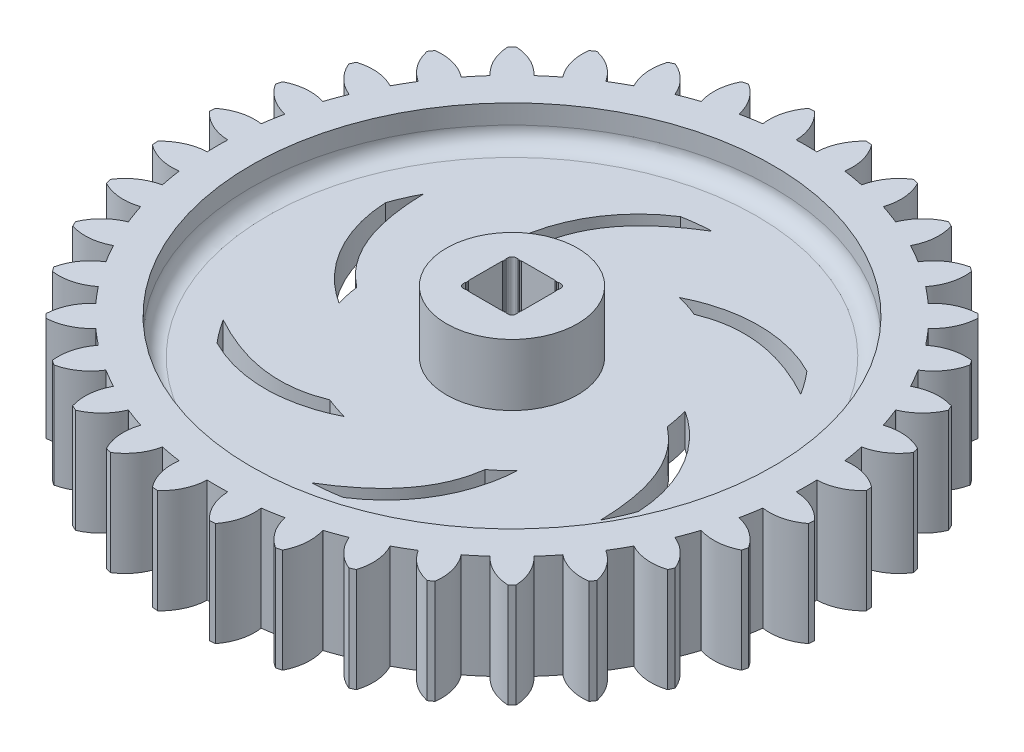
from build123d import *

# Parameters (mm, degrees)
EXTRUDE3_DEPTH     = 3.175
CIRPATTERN1_COUNT  = 36
CUT_EXTRUDE1_DEPTH = 2
CIRPATTERN2_COUNT  = 6
CUT_EXTRUDE2_DEPTH = 9.52
FILLET1_R          = 0.25
FILLET2_R          = 1


with BuildPart() as part:
    # Sketch3 → Revolve1 (revolve)
    with BuildSketch(Plane.XY, mode=Mode.PRIVATE) as revolve1_sk:
        Polygon((0, 4.76), (4, 4.76), (4, 1), (15.92, 1), (15.92, 3.175), (17.98, 3.175), (17.98, -3.175), (15.92, -3.175), (15.92, -1), (4, -1), (4, -4.76), (0, -4.76), align=None)
    revolve(revolve1_sk.sketch.rotate(Axis((0, 37.828653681, 0), (0, -1, 0)), 90), axis=Axis((0, 37.828653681, 0), (0, -1, 0)))

    # Sketch4 → Extrude3 (add, symmetric)
    with BuildSketch(Plane(origin=(0, 0, 0), x_dir=(1, 0, 0), z_dir=(0, 1, 0))):
        with BuildLine():
            Line((-2.503167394, 17.810961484), (-2.460580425, 17.507939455))
            ThreePointArc((-2.460580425, 17.507939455), (-1.540913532, 17.612722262), (-0.617023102, 17.669229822))
            Line((-0.617023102, 17.669229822), (-0.627702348, 17.975043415))
            ThreePointArc((-0.627702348, 17.975043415), (-0.89530304, 19.103785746), (-1.577349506, 20.042125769))
            ThreePointArc((-1.577349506, 20.042125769), (-1.752187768, 20.02759783), (-1.926892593, 20.011544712))
            ThreePointArc((-1.926892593, 20.011544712), (-2.435636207, 18.969024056), (-2.503167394, 17.810961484))
        make_face()
    extrude3 = extrude(amount=EXTRUDE3_DEPTH, both=True)

    # CirPattern1: Extrude3 ×36 about axis
    cirpattern1_axis = Axis((0, 0, 0), (0, 1, 0))
    for i in range(1, CIRPATTERN1_COUNT):
        add(extrude3.rotate(cirpattern1_axis, i * 360 / CIRPATTERN1_COUNT))

    # Sketch5 → Cut-Extrude1 (cut)
    with BuildSketch(Plane(origin=(0, 1, 0), x_dir=(1, 0, 0), z_dir=(0, 1, 0))):
        with BuildLine():
            ThreePointArc((-0.538693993, 12.756085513), (-1.411595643, 12.68918069), (-2.277860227, 12.562613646))
            add(Edge.make_bspline(
                [(-2.277860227, 12.562613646), (-2.278837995, 12.561982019), (-2.285488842, 12.557683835), (-2.757067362, 12.252046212), (-3.594776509, 11.586164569), (-4.59578084, 10.443819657), (-5.365528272, 9.162147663), (-5.903631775, 7.741793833), (-6.112446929, 6.610395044), (-6.160400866, 5.947536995), (-6.166292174, 5.839940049), (-6.167118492, 5.824106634)],
                knots=[-0.00040565, -0.00040565, -0.00040565, -0.00040565, 0, 0.002354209, 0.195571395, 0.388788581, 0.582005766, 0.775222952, 0.968440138, 1, 1.005436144, 1.005436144, 1.005436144, 1.005436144], degree=3))
            ThreePointArc((-6.167118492, 5.824106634), (-5.665044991, 6.313543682), (-5.124264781, 6.759843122))
            add(Edge.make_bspline(
                [(-5.124264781, 6.759843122), (-5.123935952, 6.76222343), (-5.121744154, 6.778032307), (-5.046830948, 7.305745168), (-4.795016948, 8.273957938), (-4.152616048, 9.533891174), (-3.275144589, 10.647388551), (-2.197258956, 11.63810404), (-1.263490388, 12.304176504), (-0.689777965, 12.664029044), (-0.558075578, 12.744318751), (-0.538693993, 12.756085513)],
                knots=[-0.000879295, -0.000879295, -0.000879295, -0.000879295, 0, 0.004962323, 0.194509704, 0.384057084, 0.573604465, 0.763151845, 0.952699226, 1, 1.008142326, 1.008142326, 1.008142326, 1.008142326], degree=3))
        make_face()
    cut_extrude1 = extrude(amount=-CUT_EXTRUDE1_DEPTH, mode=Mode.SUBTRACT)

    # CirPattern2: Cut-Extrude1 ×6 about axis
    cirpattern2_axis = Axis((0, 37.828653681, 0), (0, -1, 0))
    for i in range(1, CIRPATTERN2_COUNT):
        add(cut_extrude1.rotate(cirpattern2_axis, i * 360 / CIRPATTERN2_COUNT), mode=Mode.SUBTRACT)

    # Sketch6 → Cut-Extrude2 (cut)
    with BuildSketch(Plane(origin=(0, 4.76, 0), x_dir=(1, 0, 0), z_dir=(0, 1, 0))):
        Polygon((-1.2325, 1.6125), (-1.6125, 1.6125), (-1.6125, 1.2325), (-1.563002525, 1.183002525), (-1.6125, 1.133505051), (-1.563002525, 1.084007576), (-1.6125, 1.034510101), (-1.6125, -1.034510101), (-1.563002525, -1.084007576), (-1.6125, -1.133505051), (-1.563002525, -1.183002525), (-1.6125, -1.2325), (-1.6125, -1.6125), (-1.2325, -1.6125), (-1.1825, -1.5425), (-1.1325, -1.6125), (-1.0825, -1.5425), (-1.0325, -1.6125), (1.0325, -1.6125), (1.0825, -1.5425), (1.1325, -1.6125), (1.1825, -1.5425), (1.2325, -1.6125), (1.6125, -1.6125), (1.6125, -1.2325), (1.563002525, -1.183002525), (1.6125, -1.133505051), (1.563002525, -1.084007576), (1.6125, -1.034510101), (1.6125, 1.034510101), (1.563002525, 1.084007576), (1.6125, 1.133505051), (1.563002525, 1.183002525), (1.6125, 1.2325), (1.6125, 1.6125), (1.2325, 1.6125), (1.1825, 1.5425), (1.1325, 1.6125), (1.0825, 1.5425), (1.0325, 1.6125), (-1.0325, 1.6125), (-1.0825, 1.5425), (-1.1325, 1.6125), (-1.1825, 1.5425), align=None)
    extrude(amount=-CUT_EXTRUDE2_DEPTH, mode=Mode.SUBTRACT)

    # Fillet1
    fillet1_edges = [part.edges().sort_by_distance(p)[0] for p in [
        (-1.6125, 0, -1.6125),
        (1.6125, 0, -1.6125),
        (1.6125, 0, 1.6125),
        (-1.6125, 0, 1.6125),
    ]]
    fillet(fillet1_edges, radius=FILLET1_R)

    # Fillet2
    fillet2_edges = [part.edges().sort_by_distance(p)[0] for p in [
        (0, 1, -15.92),
        (0, -1, -15.92),
    ]]
    fillet(fillet2_edges, radius=FILLET2_R)


solid = part.part
